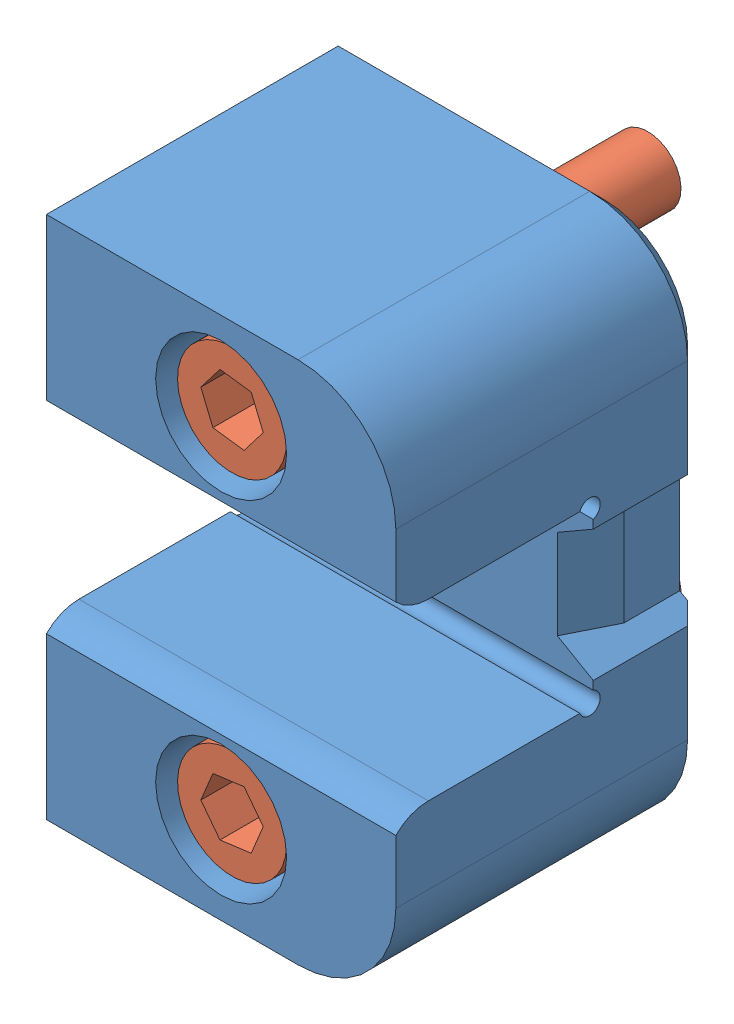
SolidWorks assembly TL100X150 FEMALE HALF.sldasm, configuration Default (file format 10000). Lengths in mm.
Overall size (25.4 38.1 31.02).
3 component instances, 2 part files, 5 mates.
Components (placement in the parent):
- TL100X150 FEMALE-1: TL100X150 FEMALE.sldprt [Default] at (12.7 0 0) x (-1 0 0) z (0 0 1) size (25.4 38.1 22.23)
- SHCS10-32L1.00-1: SHCS10-32L1.00.sldprt [SHCS10-32L1.00] at (12.7 12.7 -5.6197) x (-0.923728 -0.383049 0) z (0 0 -1) size (7.92 7.92 30.23)
- SHCS10-32L1.00-2: SHCS10-32L1.00.sldprt [SHCS10-32L1.00] at (12.7 -12.7 -5.6197) x (0.923728 -0.383049 0) z (0 0 -1) size (7.92 7.92 30.23)
Mates (geometry in assembly coordinates):
- Coincident1: coincident anti-aligned: plane of TL100X150 FEMALE-1; plane of assembly through (0 0 0) normal (0 1 0)
- Coincident2: coincident anti-aligned: plane of TL100X150 FEMALE-1 through (0 6.35 0) normal (-1 0 0); plane of assembly through (0 0 0) normal (1 0 0)
- Coincident3: coincident aligned: plane of TL100X150 FEMALE-1 through (12.7 0 0) normal (0 0 1); plane of assembly through (0 0 0) normal (0 0 1)
- Coincident4: coincident: plane of TL100X150 FEMALE-1 through (9.8933 12.7 -5.6197) normal (0 0 1); plane of SHCS10-32L1.00-1 through (33.3808 19.9362 -5.6197) normal (0 0 -1)
- Concentric2: concentric anti-aligned: cylinder of TL100X150 FEMALE-1 through (12.7 12.7 0) axis (0 0 1) radius 2.8067; cylinder of SHCS10-32L1.00-1 through (12.7 12.7 -31.0197) axis (0 0 -1) radius 2.413
